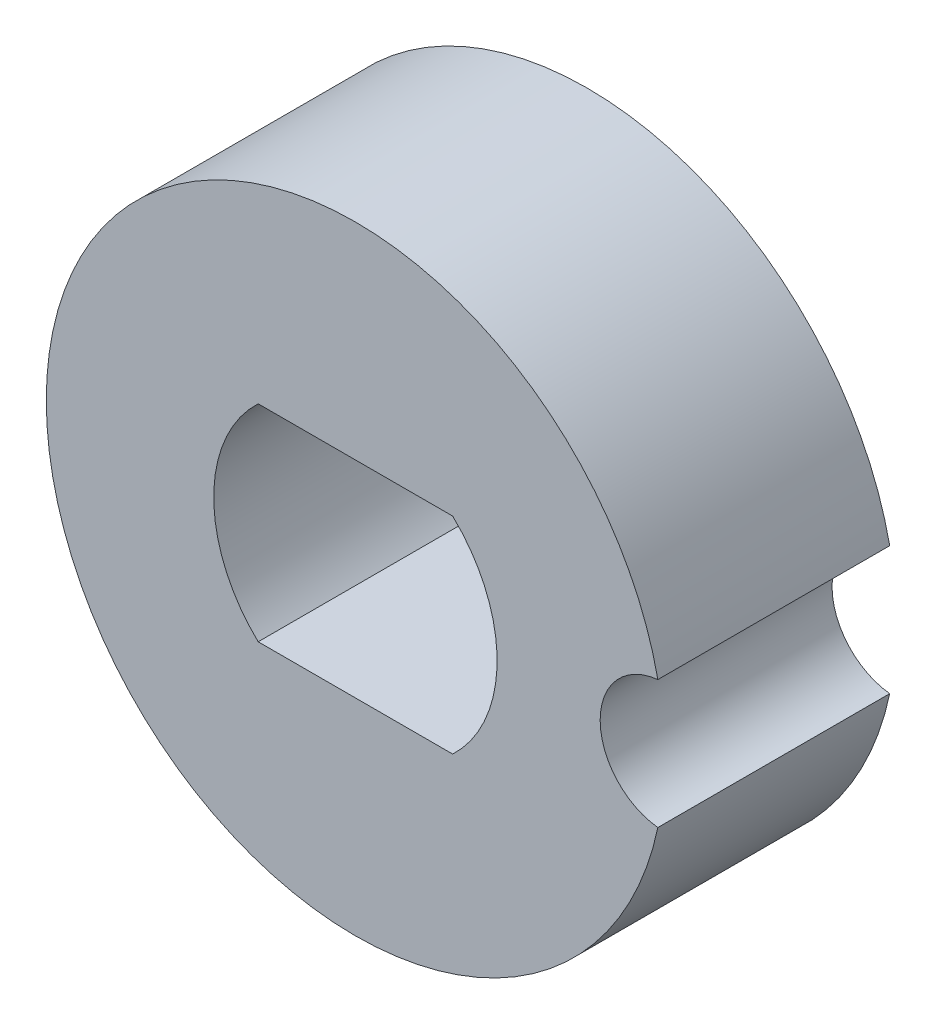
ISO-10303-21;
HEADER;
FILE_DESCRIPTION(('STEP AP214'),'2;1');
FILE_NAME('part.step','',(''),(''),'','','');
FILE_SCHEMA(('AUTOMOTIVE_DESIGN { 1 0 10303 214 1 1 1 1 }'));
ENDSEC;
DATA;
#1=APPLICATION_CONTEXT('core data for automotive mechanical design processes');
#2=APPLICATION_PROTOCOL_DEFINITION('international standard','automotive_design',2000,#1);
#3=PRODUCT_CONTEXT('',#1,'mechanical');
#4=PRODUCT('Part','Part','',(#3));
#5=PRODUCT_RELATED_PRODUCT_CATEGORY('part','',(#4));
#6=PRODUCT_DEFINITION_FORMATION('','',#4);
#7=PRODUCT_DEFINITION_CONTEXT('part definition',#1,'design');
#8=PRODUCT_DEFINITION('design','',#6,#7);
#9=PRODUCT_DEFINITION_SHAPE('','',#8);
#10=(LENGTH_UNIT() NAMED_UNIT(*) SI_UNIT(.MILLI.,.METRE.));
#11=(NAMED_UNIT(*) PLANE_ANGLE_UNIT() SI_UNIT($,.RADIAN.));
#12=(NAMED_UNIT(*) SI_UNIT($,.STERADIAN.) SOLID_ANGLE_UNIT());
#13=UNCERTAINTY_MEASURE_WITH_UNIT(LENGTH_MEASURE(1.E-05),#10,'distance_accuracy_value','');
#14=(GEOMETRIC_REPRESENTATION_CONTEXT(3) GLOBAL_UNCERTAINTY_ASSIGNED_CONTEXT((#13)) GLOBAL_UNIT_ASSIGNED_CONTEXT((#10,
#11,#12)) REPRESENTATION_CONTEXT('',''));
#15=CARTESIAN_POINT('',(0.,0.,0.));
#16=DIRECTION('',(0.,0.,1.));
#17=DIRECTION('',(1.,0.,0.));
#18=AXIS2_PLACEMENT_3D('',#15,#16,#17);
#19=CARTESIAN_POINT('',(6.,0.,9.));
#20=DIRECTION('',(0.,0.,1.));
#21=DIRECTION('',(1.,0.,0.));
#22=AXIS2_PLACEMENT_3D('',#19,#20,#21);
#23=PLANE('',#22);
#24=CARTESIAN_POINT('',(0.,0.,9.));
#25=DIRECTION('',(0.,0.,1.));
#26=DIRECTION('',(1.,0.,0.));
#27=AXIS2_PLACEMENT_3D('',#24,#25,#26);
#28=CIRCLE('',#27,12.);
#29=CARTESIAN_POINT('',(11.7395833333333,2.48639963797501,9.));
#30=VERTEX_POINT('',#29);
#31=CARTESIAN_POINT('',(11.7395833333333,-2.486399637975,9.));
#32=VERTEX_POINT('',#31);
#33=EDGE_CURVE('E105',#30,#32,#28,.T.);
#34=ORIENTED_EDGE('',*,*,#33,.T.);
#35=CARTESIAN_POINT('',(12.,0.,9.));
#36=DIRECTION('',(0.,0.,1.));
#37=DIRECTION('',(1.,0.,0.));
#38=AXIS2_PLACEMENT_3D('',#35,#36,#37);
#39=CIRCLE('',#38,2.5);
#40=EDGE_CURVE('E108',#30,#32,#39,.T.);
#41=ORIENTED_EDGE('',*,*,#40,.F.);
#42=EDGE_LOOP('',(#34,#41));
#43=FACE_BOUND('',#42,.T.);
#44=DIRECTION('',(-1.,0.,0.));
#45=VECTOR('',#44,1.);
#46=CARTESIAN_POINT('',(3.77491721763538,-4.,9.));
#47=LINE('',#46,#45);
#48=CARTESIAN_POINT('',(3.77491721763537,-4.,9.));
#49=VERTEX_POINT('',#48);
#50=CARTESIAN_POINT('',(-3.77491721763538,-4.,9.));
#51=VERTEX_POINT('',#50);
#52=EDGE_CURVE('E95',#49,#51,#47,.T.);
#53=ORIENTED_EDGE('',*,*,#52,.T.);
#54=CARTESIAN_POINT('',(0.,0.,9.));
#55=DIRECTION('',(0.,0.,1.));
#56=DIRECTION('',(1.,0.,0.));
#57=AXIS2_PLACEMENT_3D('',#54,#55,#56);
#58=CIRCLE('',#57,5.5);
#59=CARTESIAN_POINT('',(-3.77491721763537,4.,9.));
#60=VERTEX_POINT('',#59);
#61=EDGE_CURVE('E68',#60,#51,#58,.T.);
#62=ORIENTED_EDGE('',*,*,#61,.F.);
#63=DIRECTION('',(-1.,0.,0.));
#64=VECTOR('',#63,1.);
#65=CARTESIAN_POINT('',(3.77491721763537,4.,9.));
#66=LINE('',#65,#64);
#67=CARTESIAN_POINT('',(3.77491721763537,4.,9.));
#68=VERTEX_POINT('',#67);
#69=EDGE_CURVE('E90',#68,#60,#66,.T.);
#70=ORIENTED_EDGE('',*,*,#69,.F.);
#71=CARTESIAN_POINT('',(0.,0.,9.));
#72=DIRECTION('',(0.,0.,1.));
#73=DIRECTION('',(1.,0.,0.));
#74=AXIS2_PLACEMENT_3D('',#71,#72,#73);
#75=CIRCLE('',#74,5.5);
#76=EDGE_CURVE('E29',#49,#68,#75,.T.);
#77=ORIENTED_EDGE('',*,*,#76,.F.);
#78=EDGE_LOOP('',(#53,#62,#70,#77));
#79=FACE_BOUND('',#78,.T.);
#80=ADVANCED_FACE('F14',(#43,#79),#23,.T.);
#81=CARTESIAN_POINT('',(6.,0.,0.));
#82=DIRECTION('',(0.,0.,1.));
#83=DIRECTION('',(1.,0.,0.));
#84=AXIS2_PLACEMENT_3D('',#81,#82,#83);
#85=PLANE('',#84);
#86=CARTESIAN_POINT('',(0.,0.,0.));
#87=DIRECTION('',(0.,0.,1.));
#88=DIRECTION('',(1.,0.,0.));
#89=AXIS2_PLACEMENT_3D('',#86,#87,#88);
#90=CIRCLE('',#89,12.);
#91=CARTESIAN_POINT('',(11.7395833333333,2.48639963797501,0.));
#92=VERTEX_POINT('',#91);
#93=CARTESIAN_POINT('',(11.7395833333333,-2.486399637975,0.));
#94=VERTEX_POINT('',#93);
#95=EDGE_CURVE('E72',#92,#94,#90,.T.);
#96=ORIENTED_EDGE('',*,*,#95,.F.);
#97=CARTESIAN_POINT('',(12.,0.,0.));
#98=DIRECTION('',(0.,0.,1.));
#99=DIRECTION('',(1.,0.,0.));
#100=AXIS2_PLACEMENT_3D('',#97,#98,#99);
#101=CIRCLE('',#100,2.5);
#102=EDGE_CURVE('E102',#92,#94,#101,.T.);
#103=ORIENTED_EDGE('',*,*,#102,.T.);
#104=EDGE_LOOP('',(#96,#103));
#105=FACE_BOUND('',#104,.T.);
#106=CARTESIAN_POINT('',(0.,0.,0.));
#107=DIRECTION('',(0.,0.,1.));
#108=DIRECTION('',(1.,0.,0.));
#109=AXIS2_PLACEMENT_3D('',#106,#107,#108);
#110=CIRCLE('',#109,5.5);
#111=CARTESIAN_POINT('',(-3.77491721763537,4.,0.));
#112=VERTEX_POINT('',#111);
#113=CARTESIAN_POINT('',(-3.77491721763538,-4.,0.));
#114=VERTEX_POINT('',#113);
#115=EDGE_CURVE('E37',#112,#114,#110,.T.);
#116=ORIENTED_EDGE('',*,*,#115,.T.);
#117=DIRECTION('',(-1.,0.,0.));
#118=VECTOR('',#117,1.);
#119=CARTESIAN_POINT('',(3.77491721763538,-4.,0.));
#120=LINE('',#119,#118);
#121=CARTESIAN_POINT('',(3.77491721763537,-4.,0.));
#122=VERTEX_POINT('',#121);
#123=EDGE_CURVE('E76',#122,#114,#120,.T.);
#124=ORIENTED_EDGE('',*,*,#123,.F.);
#125=CARTESIAN_POINT('',(0.,0.,0.));
#126=DIRECTION('',(0.,0.,1.));
#127=DIRECTION('',(1.,0.,0.));
#128=AXIS2_PLACEMENT_3D('',#125,#126,#127);
#129=CIRCLE('',#128,5.5);
#130=CARTESIAN_POINT('',(3.77491721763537,4.,0.));
#131=VERTEX_POINT('',#130);
#132=EDGE_CURVE('E81',#122,#131,#129,.T.);
#133=ORIENTED_EDGE('',*,*,#132,.T.);
#134=DIRECTION('',(-1.,0.,0.));
#135=VECTOR('',#134,1.);
#136=CARTESIAN_POINT('',(3.77491721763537,4.,0.));
#137=LINE('',#136,#135);
#138=EDGE_CURVE('E86',#131,#112,#137,.T.);
#139=ORIENTED_EDGE('',*,*,#138,.T.);
#140=EDGE_LOOP('',(#116,#124,#133,#139));
#141=FACE_BOUND('',#140,.T.);
#142=ADVANCED_FACE('F84',(#105,#141),#85,.F.);
#143=CARTESIAN_POINT('',(0.,0.,9.));
#144=DIRECTION('',(0.,0.,-1.));
#145=DIRECTION('',(-1.,0.,0.));
#146=AXIS2_PLACEMENT_3D('',#143,#144,#145);
#147=CYLINDRICAL_SURFACE('',#146,12.);
#148=DIRECTION('',(0.,0.,-1.));
#149=VECTOR('',#148,1.);
#150=CARTESIAN_POINT('',(11.7395833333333,-2.486399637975,9.));
#151=LINE('',#150,#149);
#152=EDGE_CURVE('E9',#32,#94,#151,.T.);
#153=ORIENTED_EDGE('',*,*,#152,.F.);
#154=ORIENTED_EDGE('',*,*,#33,.F.);
#155=DIRECTION('',(0.,0.,-1.));
#156=VECTOR('',#155,1.);
#157=CARTESIAN_POINT('',(11.7395833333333,2.48639963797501,9.));
#158=LINE('',#157,#156);
#159=EDGE_CURVE('E22',#30,#92,#158,.T.);
#160=ORIENTED_EDGE('',*,*,#159,.T.);
#161=ORIENTED_EDGE('',*,*,#95,.T.);
#162=EDGE_LOOP('',(#153,#154,#160,#161));
#163=FACE_BOUND('',#162,.T.);
#164=ADVANCED_FACE('F115',(#163),#147,.T.);
#165=CARTESIAN_POINT('',(12.,0.,9.));
#166=DIRECTION('',(0.,0.,-1.));
#167=DIRECTION('',(-1.,0.,0.));
#168=AXIS2_PLACEMENT_3D('',#165,#166,#167);
#169=CYLINDRICAL_SURFACE('',#168,2.5);
#170=ORIENTED_EDGE('',*,*,#40,.T.);
#171=ORIENTED_EDGE('',*,*,#152,.T.);
#172=ORIENTED_EDGE('',*,*,#102,.F.);
#173=ORIENTED_EDGE('',*,*,#159,.F.);
#174=EDGE_LOOP('',(#170,#171,#172,#173));
#175=FACE_BOUND('',#174,.T.);
#176=ADVANCED_FACE('F16',(#175),#169,.F.);
#177=CARTESIAN_POINT('',(0.,0.,9.));
#178=DIRECTION('',(0.,0.,-1.));
#179=DIRECTION('',(-1.,0.,0.));
#180=AXIS2_PLACEMENT_3D('',#177,#178,#179);
#181=CYLINDRICAL_SURFACE('',#180,5.5);
#182=DIRECTION('',(0.,0.,-1.));
#183=VECTOR('',#182,1.);
#184=CARTESIAN_POINT('',(-3.77491721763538,-4.,9.));
#185=LINE('',#184,#183);
#186=EDGE_CURVE('E64',#51,#114,#185,.T.);
#187=ORIENTED_EDGE('',*,*,#186,.T.);
#188=ORIENTED_EDGE('',*,*,#115,.F.);
#189=DIRECTION('',(0.,0.,-1.));
#190=VECTOR('',#189,1.);
#191=CARTESIAN_POINT('',(-3.77491721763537,4.,9.));
#192=LINE('',#191,#190);
#193=EDGE_CURVE('E93',#60,#112,#192,.T.);
#194=ORIENTED_EDGE('',*,*,#193,.F.);
#195=ORIENTED_EDGE('',*,*,#61,.T.);
#196=EDGE_LOOP('',(#187,#188,#194,#195));
#197=FACE_BOUND('',#196,.T.);
#198=ADVANCED_FACE('F66',(#197),#181,.F.);
#199=CARTESIAN_POINT('',(3.77491721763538,-4.,9.));
#200=DIRECTION('',(0.,-1.,0.));
#201=DIRECTION('',(1.,0.,0.));
#202=AXIS2_PLACEMENT_3D('',#199,#200,#201);
#203=PLANE('',#202);
#204=DIRECTION('',(0.,0.,-1.));
#205=VECTOR('',#204,1.);
#206=CARTESIAN_POINT('',(3.77491721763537,-4.,9.));
#207=LINE('',#206,#205);
#208=EDGE_CURVE('E73',#49,#122,#207,.T.);
#209=ORIENTED_EDGE('',*,*,#208,.T.);
#210=ORIENTED_EDGE('',*,*,#123,.T.);
#211=ORIENTED_EDGE('',*,*,#186,.F.);
#212=ORIENTED_EDGE('',*,*,#52,.F.);
#213=EDGE_LOOP('',(#209,#210,#211,#212));
#214=FACE_BOUND('',#213,.T.);
#215=ADVANCED_FACE('F77',(#214),#203,.F.);
#216=CARTESIAN_POINT('',(0.,0.,9.));
#217=DIRECTION('',(0.,0.,-1.));
#218=DIRECTION('',(-1.,0.,0.));
#219=AXIS2_PLACEMENT_3D('',#216,#217,#218);
#220=CYLINDRICAL_SURFACE('',#219,5.5);
#221=DIRECTION('',(0.,0.,-1.));
#222=VECTOR('',#221,1.);
#223=CARTESIAN_POINT('',(3.77491721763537,4.,9.));
#224=LINE('',#223,#222);
#225=EDGE_CURVE('E99',#68,#131,#224,.T.);
#226=ORIENTED_EDGE('',*,*,#225,.T.);
#227=ORIENTED_EDGE('',*,*,#132,.F.);
#228=ORIENTED_EDGE('',*,*,#208,.F.);
#229=ORIENTED_EDGE('',*,*,#76,.T.);
#230=EDGE_LOOP('',(#226,#227,#228,#229));
#231=FACE_BOUND('',#230,.T.);
#232=ADVANCED_FACE('F127',(#231),#220,.F.);
#233=CARTESIAN_POINT('',(3.77491721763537,4.,9.));
#234=DIRECTION('',(0.,-1.,0.));
#235=DIRECTION('',(1.,0.,0.));
#236=AXIS2_PLACEMENT_3D('',#233,#234,#235);
#237=PLANE('',#236);
#238=ORIENTED_EDGE('',*,*,#69,.T.);
#239=ORIENTED_EDGE('',*,*,#193,.T.);
#240=ORIENTED_EDGE('',*,*,#138,.F.);
#241=ORIENTED_EDGE('',*,*,#225,.F.);
#242=EDGE_LOOP('',(#238,#239,#240,#241));
#243=FACE_BOUND('',#242,.T.);
#244=ADVANCED_FACE('F126',(#243),#237,.T.);
#245=CLOSED_SHELL('',(#80,#142,#164,#176,#198,#215,#232,#244));
#246=MANIFOLD_SOLID_BREP('B1',#245);
#247=ADVANCED_BREP_SHAPE_REPRESENTATION('',(#18,#246),#14);
#248=SHAPE_DEFINITION_REPRESENTATION(#9,#247);
ENDSEC;
END-ISO-10303-21;
